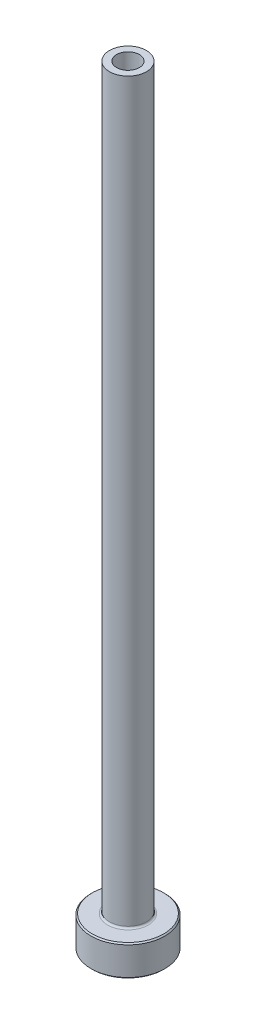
ISO-10303-21;
HEADER;
FILE_DESCRIPTION(('STEP AP214'),'2;1');
FILE_NAME('part.step','',(''),(''),'','','');
FILE_SCHEMA(('AUTOMOTIVE_DESIGN { 1 0 10303 214 1 1 1 1 }'));
ENDSEC;
DATA;
#1=APPLICATION_CONTEXT('core data for automotive mechanical design processes');
#2=APPLICATION_PROTOCOL_DEFINITION('international standard','automotive_design',2000,#1);
#3=PRODUCT_CONTEXT('',#1,'mechanical');
#4=PRODUCT('Part','Part','',(#3));
#5=PRODUCT_RELATED_PRODUCT_CATEGORY('part','',(#4));
#6=PRODUCT_DEFINITION_FORMATION('','',#4);
#7=PRODUCT_DEFINITION_CONTEXT('part definition',#1,'design');
#8=PRODUCT_DEFINITION('design','',#6,#7);
#9=PRODUCT_DEFINITION_SHAPE('','',#8);
#10=(LENGTH_UNIT() NAMED_UNIT(*) SI_UNIT(.MILLI.,.METRE.));
#11=(NAMED_UNIT(*) PLANE_ANGLE_UNIT() SI_UNIT($,.RADIAN.));
#12=(NAMED_UNIT(*) SI_UNIT($,.STERADIAN.) SOLID_ANGLE_UNIT());
#13=UNCERTAINTY_MEASURE_WITH_UNIT(LENGTH_MEASURE(1.E-05),#10,'distance_accuracy_value','');
#14=(GEOMETRIC_REPRESENTATION_CONTEXT(3) GLOBAL_UNCERTAINTY_ASSIGNED_CONTEXT((#13)) GLOBAL_UNIT_ASSIGNED_CONTEXT((#10,
#11,#12)) REPRESENTATION_CONTEXT('',''));
#15=CARTESIAN_POINT('',(0.,0.,0.));
#16=DIRECTION('',(0.,0.,1.));
#17=DIRECTION('',(1.,0.,0.));
#18=AXIS2_PLACEMENT_3D('',#15,#16,#17);
#19=CARTESIAN_POINT('',(0.,92.1876809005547,0.));
#20=DIRECTION('',(0.,1.,0.));
#21=DIRECTION('',(0.,0.,1.));
#22=AXIS2_PLACEMENT_3D('',#19,#20,#21);
#23=CYLINDRICAL_SURFACE('',#22,1.85);
#24=CARTESIAN_POINT('',(0.,125.,0.));
#25=DIRECTION('',(0.,1.,0.));
#26=DIRECTION('',(0.,0.,1.));
#27=AXIS2_PLACEMENT_3D('',#24,#25,#26);
#28=CIRCLE('',#27,1.85);
#29=CARTESIAN_POINT('',(0.,125.,1.85));
#30=VERTEX_POINT('',#29);
#31=EDGE_CURVE('E62',#30,#30,#28,.T.);
#32=ORIENTED_EDGE('',*,*,#31,.T.);
#33=EDGE_LOOP('',(#32));
#34=FACE_BOUND('',#33,.T.);
#35=CARTESIAN_POINT('',(0.,80.,0.));
#36=DIRECTION('',(0.,1.,0.));
#37=DIRECTION('',(0.,0.,1.));
#38=AXIS2_PLACEMENT_3D('',#35,#36,#37);
#39=CIRCLE('',#38,1.85);
#40=CARTESIAN_POINT('',(0.,80.,1.85));
#41=VERTEX_POINT('',#40);
#42=EDGE_CURVE('E71',#41,#41,#39,.T.);
#43=ORIENTED_EDGE('',*,*,#42,.F.);
#44=EDGE_LOOP('',(#43));
#45=FACE_BOUND('',#44,.T.);
#46=ADVANCED_FACE('F30',(#34,#45),#23,.F.);
#47=CARTESIAN_POINT('',(-1.85,125.,0.));
#48=DIRECTION('',(0.,1.,0.));
#49=DIRECTION('',(0.,0.,1.));
#50=AXIS2_PLACEMENT_3D('',#47,#48,#49);
#51=PLANE('',#50);
#52=CARTESIAN_POINT('',(0.,125.,0.));
#53=DIRECTION('',(0.,1.,0.));
#54=DIRECTION('',(0.,0.,1.));
#55=AXIS2_PLACEMENT_3D('',#52,#53,#54);
#56=CIRCLE('',#55,3.);
#57=CARTESIAN_POINT('',(0.,125.,3.));
#58=VERTEX_POINT('',#57);
#59=EDGE_CURVE('E65',#58,#58,#56,.T.);
#60=ORIENTED_EDGE('',*,*,#59,.T.);
#61=EDGE_LOOP('',(#60));
#62=FACE_BOUND('',#61,.T.);
#63=ORIENTED_EDGE('',*,*,#31,.F.);
#64=EDGE_LOOP('',(#63));
#65=FACE_BOUND('',#64,.T.);
#66=ADVANCED_FACE('F79',(#62,#65),#51,.T.);
#67=CARTESIAN_POINT('',(0.,92.1876809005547,0.));
#68=DIRECTION('',(0.,1.,0.));
#69=DIRECTION('',(0.,0.,1.));
#70=AXIS2_PLACEMENT_3D('',#67,#68,#69);
#71=CYLINDRICAL_SURFACE('',#70,3.);
#72=CARTESIAN_POINT('',(0.,5.3,0.));
#73=DIRECTION('',(0.,1.,0.));
#74=DIRECTION('',(0.,0.,1.));
#75=AXIS2_PLACEMENT_3D('',#72,#73,#74);
#76=CIRCLE('',#75,3.);
#77=CARTESIAN_POINT('',(0.,5.3,3.));
#78=VERTEX_POINT('',#77);
#79=EDGE_CURVE('E59',#78,#78,#76,.T.);
#80=ORIENTED_EDGE('',*,*,#79,.T.);
#81=EDGE_LOOP('',(#80));
#82=FACE_BOUND('',#81,.T.);
#83=ORIENTED_EDGE('',*,*,#59,.F.);
#84=EDGE_LOOP('',(#83));
#85=FACE_BOUND('',#84,.T.);
#86=ADVANCED_FACE('F85',(#82,#85),#71,.T.);
#87=CARTESIAN_POINT('',(-2.99999999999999,5.,0.));
#88=DIRECTION('',(0.,1.,0.));
#89=DIRECTION('',(0.,0.,1.));
#90=AXIS2_PLACEMENT_3D('',#87,#88,#89);
#91=PLANE('',#90);
#92=CARTESIAN_POINT('',(0.,5.,0.));
#93=DIRECTION('',(0.,1.,0.));
#94=DIRECTION('',(0.,0.,1.));
#95=AXIS2_PLACEMENT_3D('',#92,#93,#94);
#96=CIRCLE('',#95,5.79999999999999);
#97=CARTESIAN_POINT('',(0.,5.,5.79999999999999));
#98=VERTEX_POINT('',#97);
#99=EDGE_CURVE('E53',#98,#98,#96,.T.);
#100=ORIENTED_EDGE('',*,*,#99,.T.);
#101=EDGE_LOOP('',(#100));
#102=FACE_BOUND('',#101,.T.);
#103=CARTESIAN_POINT('',(0.,5.,0.));
#104=DIRECTION('',(0.,1.,0.));
#105=DIRECTION('',(0.,0.,1.));
#106=AXIS2_PLACEMENT_3D('',#103,#104,#105);
#107=CIRCLE('',#106,3.3);
#108=CARTESIAN_POINT('',(0.,5.,3.3));
#109=VERTEX_POINT('',#108);
#110=EDGE_CURVE('E56',#109,#109,#107,.F.);
#111=ORIENTED_EDGE('',*,*,#110,.T.);
#112=EDGE_LOOP('',(#111));
#113=FACE_BOUND('',#112,.T.);
#114=ADVANCED_FACE('F111',(#102,#113),#91,.T.);
#115=CARTESIAN_POINT('',(0.,92.1876809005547,0.));
#116=DIRECTION('',(0.,1.,0.));
#117=DIRECTION('',(0.,0.,1.));
#118=AXIS2_PLACEMENT_3D('',#115,#116,#117);
#119=CYLINDRICAL_SURFACE('',#118,5.99999999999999);
#120=CARTESIAN_POINT('',(0.,4.8,0.));
#121=DIRECTION('',(0.,1.,0.));
#122=DIRECTION('',(0.,0.,1.));
#123=AXIS2_PLACEMENT_3D('',#120,#121,#122);
#124=CIRCLE('',#123,5.99999999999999);
#125=CARTESIAN_POINT('',(0.,4.8,5.99999999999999));
#126=VERTEX_POINT('',#125);
#127=EDGE_CURVE('E45',#126,#126,#124,.F.);
#128=ORIENTED_EDGE('',*,*,#127,.T.);
#129=EDGE_LOOP('',(#128));
#130=FACE_BOUND('',#129,.T.);
#131=CARTESIAN_POINT('',(0.,0.20000000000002,0.));
#132=DIRECTION('',(0.,-1.,0.));
#133=DIRECTION('',(0.,0.,-1.));
#134=AXIS2_PLACEMENT_3D('',#131,#132,#133);
#135=CIRCLE('',#134,5.99999999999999);
#136=CARTESIAN_POINT('',(0.,0.20000000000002,-5.99999999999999));
#137=VERTEX_POINT('',#136);
#138=EDGE_CURVE('E50',#137,#137,#135,.F.);
#139=ORIENTED_EDGE('',*,*,#138,.T.);
#140=EDGE_LOOP('',(#139));
#141=FACE_BOUND('',#140,.T.);
#142=ADVANCED_FACE('F108',(#130,#141),#119,.T.);
#143=CARTESIAN_POINT('',(-5.99999999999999,0.,0.));
#144=DIRECTION('',(0.,-1.,0.));
#145=DIRECTION('',(0.,0.,-1.));
#146=AXIS2_PLACEMENT_3D('',#143,#144,#145);
#147=PLANE('',#146);
#148=CARTESIAN_POINT('',(0.,0.,0.));
#149=DIRECTION('',(0.,-1.,0.));
#150=DIRECTION('',(0.,0.,-1.));
#151=AXIS2_PLACEMENT_3D('',#148,#149,#150);
#152=CIRCLE('',#151,2.59999999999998);
#153=CARTESIAN_POINT('',(0.,0.,-2.59999999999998));
#154=VERTEX_POINT('',#153);
#155=EDGE_CURVE('E37',#154,#154,#152,.F.);
#156=ORIENTED_EDGE('',*,*,#155,.T.);
#157=EDGE_LOOP('',(#156));
#158=FACE_BOUND('',#157,.T.);
#159=CARTESIAN_POINT('',(0.,0.,0.));
#160=DIRECTION('',(0.,-1.,0.));
#161=DIRECTION('',(0.,0.,-1.));
#162=AXIS2_PLACEMENT_3D('',#159,#160,#161);
#163=CIRCLE('',#162,5.79999999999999);
#164=CARTESIAN_POINT('',(0.,0.,-5.79999999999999));
#165=VERTEX_POINT('',#164);
#166=EDGE_CURVE('E41',#165,#165,#163,.T.);
#167=ORIENTED_EDGE('',*,*,#166,.T.);
#168=EDGE_LOOP('',(#167));
#169=FACE_BOUND('',#168,.T.);
#170=ADVANCED_FACE('F110',(#158,#169),#147,.T.);
#171=CARTESIAN_POINT('',(0.,92.1876809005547,0.));
#172=DIRECTION('',(0.,1.,0.));
#173=DIRECTION('',(0.,0.,1.));
#174=AXIS2_PLACEMENT_3D('',#171,#172,#173);
#175=CYLINDRICAL_SURFACE('',#174,2.09999999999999);
#176=CARTESIAN_POINT('',(0.,0.499999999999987,0.));
#177=DIRECTION('',(0.,-1.,0.));
#178=DIRECTION('',(0.,0.,-1.));
#179=AXIS2_PLACEMENT_3D('',#176,#177,#178);
#180=CIRCLE('',#179,2.09999999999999);
#181=CARTESIAN_POINT('',(0.,0.499999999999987,-2.09999999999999));
#182=VERTEX_POINT('',#181);
#183=EDGE_CURVE('E10',#182,#182,#180,.T.);
#184=ORIENTED_EDGE('',*,*,#183,.T.);
#185=EDGE_LOOP('',(#184));
#186=FACE_BOUND('',#185,.T.);
#187=CARTESIAN_POINT('',(0.,68.,0.));
#188=DIRECTION('',(0.,1.,0.));
#189=DIRECTION('',(0.,0.,1.));
#190=AXIS2_PLACEMENT_3D('',#187,#188,#189);
#191=CIRCLE('',#190,2.1);
#192=CARTESIAN_POINT('',(0.,68.,2.1));
#193=VERTEX_POINT('',#192);
#194=EDGE_CURVE('E68',#193,#193,#191,.T.);
#195=ORIENTED_EDGE('',*,*,#194,.T.);
#196=EDGE_LOOP('',(#195));
#197=FACE_BOUND('',#196,.T.);
#198=ADVANCED_FACE('F118',(#186,#197),#175,.F.);
#199=CARTESIAN_POINT('',(0.,68.,0.));
#200=DIRECTION('',(0.,-1.,0.));
#201=DIRECTION('',(0.,0.,-1.));
#202=AXIS2_PLACEMENT_3D('',#199,#200,#201);
#203=CONICAL_SURFACE('',#202,2.1,0.0208303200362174);
#204=ORIENTED_EDGE('',*,*,#42,.T.);
#205=EDGE_LOOP('',(#204));
#206=FACE_BOUND('',#205,.T.);
#207=ORIENTED_EDGE('',*,*,#194,.F.);
#208=EDGE_LOOP('',(#207));
#209=FACE_BOUND('',#208,.T.);
#210=ADVANCED_FACE('F75',(#206,#209),#203,.F.);
#211=CARTESIAN_POINT('',(0.,5.3,0.));
#212=DIRECTION('',(0.,1.,0.));
#213=DIRECTION('',(0.,0.,1.));
#214=AXIS2_PLACEMENT_3D('',#211,#212,#213);
#215=TOROIDAL_SURFACE('',#214,3.3,0.3);
#216=ORIENTED_EDGE('',*,*,#110,.F.);
#217=EDGE_LOOP('',(#216));
#218=FACE_BOUND('',#217,.T.);
#219=ORIENTED_EDGE('',*,*,#79,.F.);
#220=EDGE_LOOP('',(#219));
#221=FACE_BOUND('',#220,.T.);
#222=ADVANCED_FACE('F90',(#218,#221),#215,.F.);
#223=CARTESIAN_POINT('',(0.,5.,0.));
#224=DIRECTION('',(0.,-1.,0.));
#225=DIRECTION('',(0.,0.,-1.));
#226=AXIS2_PLACEMENT_3D('',#223,#224,#225);
#227=CONICAL_SURFACE('',#226,5.79999999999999,0.785398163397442);
#228=ORIENTED_EDGE('',*,*,#127,.F.);
#229=EDGE_LOOP('',(#228));
#230=FACE_BOUND('',#229,.T.);
#231=ORIENTED_EDGE('',*,*,#99,.F.);
#232=EDGE_LOOP('',(#231));
#233=FACE_BOUND('',#232,.T.);
#234=ADVANCED_FACE('F93',(#230,#233),#227,.T.);
#235=CARTESIAN_POINT('',(0.,0.20000000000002,0.));
#236=DIRECTION('',(0.,1.,0.));
#237=DIRECTION('',(0.,0.,1.));
#238=AXIS2_PLACEMENT_3D('',#235,#236,#237);
#239=CONICAL_SURFACE('',#238,5.99999999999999,0.785398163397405);
#240=ORIENTED_EDGE('',*,*,#166,.F.);
#241=EDGE_LOOP('',(#240));
#242=FACE_BOUND('',#241,.T.);
#243=ORIENTED_EDGE('',*,*,#138,.F.);
#244=EDGE_LOOP('',(#243));
#245=FACE_BOUND('',#244,.T.);
#246=ADVANCED_FACE('F96',(#242,#245),#239,.T.);
#247=CARTESIAN_POINT('',(0.,0.,0.));
#248=DIRECTION('',(0.,-1.,0.));
#249=DIRECTION('',(0.,0.,-1.));
#250=AXIS2_PLACEMENT_3D('',#247,#248,#249);
#251=CONICAL_SURFACE('',#250,2.59999999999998,0.785398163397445);
#252=ORIENTED_EDGE('',*,*,#183,.F.);
#253=EDGE_LOOP('',(#252));
#254=FACE_BOUND('',#253,.T.);
#255=ORIENTED_EDGE('',*,*,#155,.F.);
#256=EDGE_LOOP('',(#255));
#257=FACE_BOUND('',#256,.T.);
#258=ADVANCED_FACE('F32',(#254,#257),#251,.F.);
#259=CLOSED_SHELL('',(#46,#66,#86,#114,#142,#170,#198,#210,#222,#234,#246,#258));
#260=MANIFOLD_SOLID_BREP('B2',#259);
#261=ADVANCED_BREP_SHAPE_REPRESENTATION('',(#18,#260),#14);
#262=SHAPE_DEFINITION_REPRESENTATION(#9,#261);
ENDSEC;
END-ISO-10303-21;
